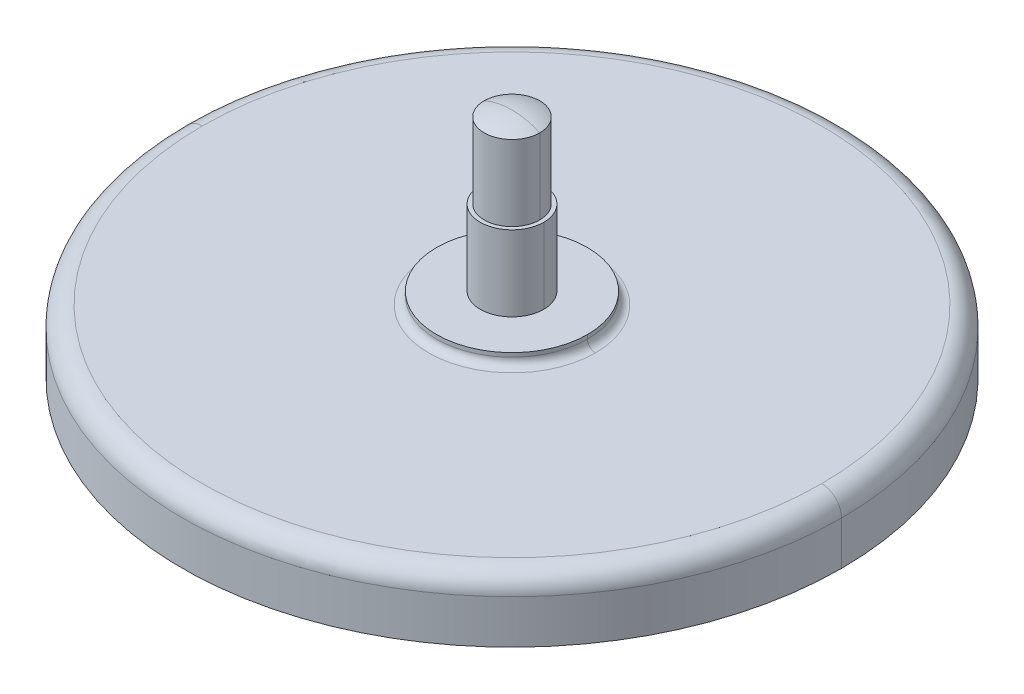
ISO-10303-21;
HEADER;
FILE_DESCRIPTION(('STEP AP214'),'2;1');
FILE_NAME('part.step','',(''),(''),'','','');
FILE_SCHEMA(('AUTOMOTIVE_DESIGN { 1 0 10303 214 1 1 1 1 }'));
ENDSEC;
DATA;
#1=APPLICATION_CONTEXT('core data for automotive mechanical design processes');
#2=APPLICATION_PROTOCOL_DEFINITION('international standard','automotive_design',2000,#1);
#3=PRODUCT_CONTEXT('',#1,'mechanical');
#4=PRODUCT('Part','Part','',(#3));
#5=PRODUCT_RELATED_PRODUCT_CATEGORY('part','',(#4));
#6=PRODUCT_DEFINITION_FORMATION('','',#4);
#7=PRODUCT_DEFINITION_CONTEXT('part definition',#1,'design');
#8=PRODUCT_DEFINITION('design','',#6,#7);
#9=PRODUCT_DEFINITION_SHAPE('','',#8);
#10=(LENGTH_UNIT() NAMED_UNIT(*) SI_UNIT(.MILLI.,.METRE.));
#11=(NAMED_UNIT(*) PLANE_ANGLE_UNIT() SI_UNIT($,.RADIAN.));
#12=(NAMED_UNIT(*) SI_UNIT($,.STERADIAN.) SOLID_ANGLE_UNIT());
#13=UNCERTAINTY_MEASURE_WITH_UNIT(LENGTH_MEASURE(1.E-05),#10,'distance_accuracy_value','');
#14=(GEOMETRIC_REPRESENTATION_CONTEXT(3) GLOBAL_UNCERTAINTY_ASSIGNED_CONTEXT((#13)) GLOBAL_UNIT_ASSIGNED_CONTEXT((#10,
#11,#12)) REPRESENTATION_CONTEXT('',''));
#15=CARTESIAN_POINT('',(0.,0.,0.));
#16=DIRECTION('',(0.,0.,1.));
#17=DIRECTION('',(1.,0.,0.));
#18=AXIS2_PLACEMENT_3D('',#15,#16,#17);
#19=CARTESIAN_POINT('',(1.90385901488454E-12,-544.949342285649,-3.71230823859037E-13));
#20=DIRECTION('',(0.,-1.,0.));
#21=DIRECTION('',(1.,0.,0.));
#22=AXIS2_PLACEMENT_3D('',#19,#20,#21);
#23=CYLINDRICAL_SURFACE('',#22,73.);
#24=DIRECTION('',(0.,-1.,0.));
#25=VECTOR('',#24,1.);
#26=CARTESIAN_POINT('',(-72.9999999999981,-544.94934228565,-2.52878423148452E-13));
#27=LINE('',#26,#25);
#28=CARTESIAN_POINT('',(-73.,0.999999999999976,1.18352400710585E-13));
#29=VERTEX_POINT('',#28);
#30=CARTESIAN_POINT('',(-73.,0.,0.));
#31=VERTEX_POINT('',#30);
#32=EDGE_CURVE('E169',#29,#31,#27,.T.);
#33=ORIENTED_EDGE('',*,*,#32,.F.);
#34=CARTESIAN_POINT('',(0.,1.00000000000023,0.));
#35=DIRECTION('',(0.,-1.,0.));
#36=DIRECTION('',(1.,0.,0.));
#37=AXIS2_PLACEMENT_3D('',#34,#35,#36);
#38=CIRCLE('',#37,73.);
#39=CARTESIAN_POINT('',(73.,1.00000000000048,-1.09412479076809E-13));
#40=VERTEX_POINT('',#39);
#41=EDGE_CURVE('E11',#40,#29,#38,.T.);
#42=ORIENTED_EDGE('',*,*,#41,.F.);
#43=DIRECTION('',(0.,-1.,0.));
#44=VECTOR('',#43,1.);
#45=CARTESIAN_POINT('',(73.0000000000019,-544.949342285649,-4.80643302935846E-13));
#46=LINE('',#45,#44);
#47=CARTESIAN_POINT('',(73.,4.75061106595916E-13,-1.09412479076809E-13));
#48=VERTEX_POINT('',#47);
#49=EDGE_CURVE('E178',#40,#48,#46,.T.);
#50=ORIENTED_EDGE('',*,*,#49,.T.);
#51=CARTESIAN_POINT('',(0.,2.22044604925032E-13,0.));
#52=DIRECTION('',(0.,-1.,0.));
#53=DIRECTION('',(1.,0.,0.));
#54=AXIS2_PLACEMENT_3D('',#51,#52,#53);
#55=CIRCLE('',#54,73.);
#56=EDGE_CURVE('E170',#48,#31,#55,.T.);
#57=ORIENTED_EDGE('',*,*,#56,.T.);
#58=EDGE_LOOP('',(#33,#42,#50,#57));
#59=FACE_BOUND('',#58,.T.);
#60=ADVANCED_FACE('F17',(#59),#23,.F.);
#61=CARTESIAN_POINT('',(0.,1.00000000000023,0.));
#62=DIRECTION('',(0.,-1.,0.));
#63=DIRECTION('',(1.,0.,0.));
#64=AXIS2_PLACEMENT_3D('',#61,#62,#63);
#65=TOROIDAL_SURFACE('',#64,71.,2.);
#66=CARTESIAN_POINT('',(-71.,0.999999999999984,1.15109869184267E-13));
#67=DIRECTION('',(0.,0.,1.));
#68=DIRECTION('',(1.,0.,0.));
#69=AXIS2_PLACEMENT_3D('',#66,#67,#68);
#70=CIRCLE('',#69,2.);
#71=CARTESIAN_POINT('',(-71.,3.,1.17236354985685E-13));
#72=VERTEX_POINT('',#71);
#73=EDGE_CURVE('E151',#72,#29,#70,.T.);
#74=ORIENTED_EDGE('',*,*,#73,.F.);
#75=CARTESIAN_POINT('',(0.,3.00000000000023,0.));
#76=DIRECTION('',(0.,-1.,0.));
#77=DIRECTION('',(1.,0.,0.));
#78=AXIS2_PLACEMENT_3D('',#75,#76,#77);
#79=CIRCLE('',#78,71.);
#80=CARTESIAN_POINT('',(71.,3.00000000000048,-1.06414876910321E-13));
#81=VERTEX_POINT('',#80);
#82=EDGE_CURVE('E20',#81,#72,#79,.T.);
#83=ORIENTED_EDGE('',*,*,#82,.F.);
#84=CARTESIAN_POINT('',(71.,1.00000000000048,-1.06414876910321E-13));
#85=DIRECTION('',(0.,0.,-1.));
#86=DIRECTION('',(-1.,0.,0.));
#87=AXIS2_PLACEMENT_3D('',#84,#85,#86);
#88=CIRCLE('',#87,2.);
#89=EDGE_CURVE('E154',#81,#40,#88,.T.);
#90=ORIENTED_EDGE('',*,*,#89,.T.);
#91=ORIENTED_EDGE('',*,*,#41,.T.);
#92=EDGE_LOOP('',(#74,#83,#90,#91));
#93=FACE_BOUND('',#92,.T.);
#94=ADVANCED_FACE('F150',(#93),#65,.F.);
#95=CARTESIAN_POINT('',(0.,3.00000000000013,0.));
#96=DIRECTION('',(0.,1.,0.));
#97=DIRECTION('',(1.,0.,0.));
#98=AXIS2_PLACEMENT_3D('',#95,#96,#97);
#99=PLANE('',#98);
#100=ORIENTED_EDGE('',*,*,#82,.T.);
#101=CARTESIAN_POINT('',(0.,3.00000000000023,0.));
#102=DIRECTION('',(0.,-1.,0.));
#103=DIRECTION('',(1.,0.,0.));
#104=AXIS2_PLACEMENT_3D('',#101,#102,#103);
#105=CIRCLE('',#104,71.);
#106=EDGE_CURVE('E165',#72,#81,#105,.T.);
#107=ORIENTED_EDGE('',*,*,#106,.T.);
#108=EDGE_LOOP('',(#100,#107));
#109=FACE_BOUND('',#108,.T.);
#110=ADVANCED_FACE('F334',(#109),#99,.F.);
#111=CARTESIAN_POINT('',(0.,41.4166666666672,0.));
#112=DIRECTION('',(0.,0.,1.));
#113=DIRECTION('',(1.,0.,0.));
#114=AXIS2_PLACEMENT_3D('',#111,#112,#113);
#115=SPHERICAL_SURFACE('',#114,17.0833333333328);
#116=CARTESIAN_POINT('',(0.,41.4166666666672,0.));
#117=DIRECTION('',(0.,0.,1.));
#118=DIRECTION('',(1.,0.,0.));
#119=AXIS2_PLACEMENT_3D('',#116,#117,#118);
#120=CIRCLE('',#119,17.0833333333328);
#121=CARTESIAN_POINT('',(0.,58.5,0.));
#122=VERTEX_POINT('',#121);
#123=CARTESIAN_POINT('',(-6.9999999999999,57.,0.));
#124=VERTEX_POINT('',#123);
#125=EDGE_CURVE('E218',#122,#124,#120,.T.);
#126=ORIENTED_EDGE('',*,*,#125,.F.);
#127=CARTESIAN_POINT('',(0.,41.4166666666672,0.));
#128=DIRECTION('',(0.,0.,-1.));
#129=DIRECTION('',(-1.,0.,0.));
#130=AXIS2_PLACEMENT_3D('',#127,#128,#129);
#131=CIRCLE('',#130,17.0833333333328);
#132=CARTESIAN_POINT('',(6.9999999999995,57.,0.));
#133=VERTEX_POINT('',#132);
#134=EDGE_CURVE('E214',#122,#133,#131,.T.);
#135=ORIENTED_EDGE('',*,*,#134,.T.);
#136=CARTESIAN_POINT('',(-1.98625837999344E-13,57.,0.));
#137=DIRECTION('',(0.,-1.,0.));
#138=DIRECTION('',(1.,0.,0.));
#139=AXIS2_PLACEMENT_3D('',#136,#137,#138);
#140=CIRCLE('',#139,6.9999999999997);
#141=EDGE_CURVE('E279',#124,#133,#140,.T.);
#142=ORIENTED_EDGE('',*,*,#141,.F.);
#143=EDGE_LOOP('',(#126,#135,#142));
#144=FACE_BOUND('',#143,.T.);
#145=ADVANCED_FACE('F332',(#144),#115,.T.);
#146=CARTESIAN_POINT('',(1.90385901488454E-12,-544.949342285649,-3.71230823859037E-13));
#147=DIRECTION('',(0.,-1.,0.));
#148=DIRECTION('',(1.,0.,0.));
#149=AXIS2_PLACEMENT_3D('',#146,#147,#148);
#150=CYLINDRICAL_SURFACE('',#149,6.99999999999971);
#151=DIRECTION('',(0.,-1.,0.));
#152=VECTOR('',#151,1.);
#153=CARTESIAN_POINT('',(-6.99999999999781,-544.949342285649,-3.59881963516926E-13));
#154=LINE('',#153,#152);
#155=CARTESIAN_POINT('',(-6.99999999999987,38.,0.));
#156=VERTEX_POINT('',#155);
#157=EDGE_CURVE('E206',#124,#156,#154,.T.);
#158=ORIENTED_EDGE('',*,*,#157,.F.);
#159=ORIENTED_EDGE('',*,*,#141,.T.);
#160=DIRECTION('',(0.,-1.,0.));
#161=VECTOR('',#160,1.);
#162=CARTESIAN_POINT('',(7.00000000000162,-544.949342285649,-3.81722431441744E-13));
#163=LINE('',#162,#161);
#164=CARTESIAN_POINT('',(6.9999999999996,38.,0.));
#165=VERTEX_POINT('',#164);
#166=EDGE_CURVE('E205',#133,#165,#163,.T.);
#167=ORIENTED_EDGE('',*,*,#166,.T.);
#168=CARTESIAN_POINT('',(-1.31838984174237E-13,38.,0.));
#169=DIRECTION('',(0.,-1.,0.));
#170=DIRECTION('',(1.,0.,0.));
#171=AXIS2_PLACEMENT_3D('',#168,#169,#170);
#172=CIRCLE('',#171,6.99999999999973);
#173=EDGE_CURVE('E282',#156,#165,#172,.T.);
#174=ORIENTED_EDGE('',*,*,#173,.F.);
#175=EDGE_LOOP('',(#158,#159,#167,#174));
#176=FACE_BOUND('',#175,.T.);
#177=ADVANCED_FACE('F323',(#176),#150,.T.);
#178=CARTESIAN_POINT('',(-8.,38.,0.));
#179=DIRECTION('',(0.,-1.,0.));
#180=DIRECTION('',(0.,0.,-1.));
#181=AXIS2_PLACEMENT_3D('',#178,#179,#180);
#182=PLANE('',#181);
#183=CARTESIAN_POINT('',(-1.31838984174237E-13,38.,0.));
#184=DIRECTION('',(0.,-1.,0.));
#185=DIRECTION('',(1.,0.,0.));
#186=AXIS2_PLACEMENT_3D('',#183,#184,#185);
#187=CIRCLE('',#186,6.99999999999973);
#188=EDGE_CURVE('E210',#165,#156,#187,.T.);
#189=ORIENTED_EDGE('',*,*,#188,.T.);
#190=ORIENTED_EDGE('',*,*,#173,.T.);
#191=EDGE_LOOP('',(#189,#190));
#192=FACE_BOUND('',#191,.T.);
#193=CARTESIAN_POINT('',(-1.31838984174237E-13,38.,0.));
#194=DIRECTION('',(0.,-1.,0.));
#195=DIRECTION('',(1.,0.,0.));
#196=AXIS2_PLACEMENT_3D('',#193,#194,#195);
#197=CIRCLE('',#196,7.9999999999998);
#198=CARTESIAN_POINT('',(7.99999999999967,38.,0.));
#199=VERTEX_POINT('',#198);
#200=CARTESIAN_POINT('',(-8.,38.,0.));
#201=VERTEX_POINT('',#200);
#202=EDGE_CURVE('E200',#199,#201,#197,.T.);
#203=ORIENTED_EDGE('',*,*,#202,.F.);
#204=CARTESIAN_POINT('',(-1.31838984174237E-13,38.,0.));
#205=DIRECTION('',(0.,-1.,0.));
#206=DIRECTION('',(1.,0.,0.));
#207=AXIS2_PLACEMENT_3D('',#204,#205,#206);
#208=CIRCLE('',#207,7.9999999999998);
#209=EDGE_CURVE('E310',#201,#199,#208,.T.);
#210=ORIENTED_EDGE('',*,*,#209,.F.);
#211=EDGE_LOOP('',(#203,#210));
#212=FACE_BOUND('',#211,.T.);
#213=ADVANCED_FACE('F317',(#192,#212),#182,.F.);
#214=CARTESIAN_POINT('',(1.90385901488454E-12,-544.949342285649,-3.71230823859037E-13));
#215=DIRECTION('',(0.,-1.,0.));
#216=DIRECTION('',(1.,0.,0.));
#217=AXIS2_PLACEMENT_3D('',#214,#215,#216);
#218=CYLINDRICAL_SURFACE('',#217,7.99999999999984);
#219=DIRECTION('',(0.,-1.,0.));
#220=VECTOR('',#219,1.);
#221=CARTESIAN_POINT('',(-7.99999999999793,-544.949342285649,-3.58260697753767E-13));
#222=LINE('',#221,#220);
#223=CARTESIAN_POINT('',(-8.,19.,0.));
#224=VERTEX_POINT('',#223);
#225=EDGE_CURVE('E204',#201,#224,#222,.T.);
#226=ORIENTED_EDGE('',*,*,#225,.F.);
#227=ORIENTED_EDGE('',*,*,#209,.T.);
#228=DIRECTION('',(0.,-1.,0.));
#229=VECTOR('',#228,1.);
#230=CARTESIAN_POINT('',(8.00000000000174,-544.949342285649,-3.83221232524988E-13));
#231=LINE('',#230,#229);
#232=CARTESIAN_POINT('',(7.9999999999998,19.,0.));
#233=VERTEX_POINT('',#232);
#234=EDGE_CURVE('E235',#199,#233,#231,.T.);
#235=ORIENTED_EDGE('',*,*,#234,.T.);
#236=CARTESIAN_POINT('',(0.,19.,0.));
#237=DIRECTION('',(0.,-1.,0.));
#238=DIRECTION('',(1.,0.,0.));
#239=AXIS2_PLACEMENT_3D('',#236,#237,#238);
#240=CIRCLE('',#239,7.99999999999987);
#241=EDGE_CURVE('E307',#224,#233,#240,.T.);
#242=ORIENTED_EDGE('',*,*,#241,.F.);
#243=EDGE_LOOP('',(#226,#227,#235,#242));
#244=FACE_BOUND('',#243,.T.);
#245=ADVANCED_FACE('F384',(#244),#218,.T.);
#246=CARTESIAN_POINT('',(-19.,19.,0.));
#247=DIRECTION('',(0.,-1.,0.));
#248=DIRECTION('',(0.,0.,-1.));
#249=AXIS2_PLACEMENT_3D('',#246,#247,#248);
#250=PLANE('',#249);
#251=CARTESIAN_POINT('',(0.,19.,0.));
#252=DIRECTION('',(0.,-1.,0.));
#253=DIRECTION('',(1.,0.,0.));
#254=AXIS2_PLACEMENT_3D('',#251,#252,#253);
#255=CIRCLE('',#254,7.99999999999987);
#256=EDGE_CURVE('E231',#233,#224,#255,.T.);
#257=ORIENTED_EDGE('',*,*,#256,.T.);
#258=ORIENTED_EDGE('',*,*,#241,.T.);
#259=EDGE_LOOP('',(#257,#258));
#260=FACE_BOUND('',#259,.T.);
#261=CARTESIAN_POINT('',(0.,19.,0.));
#262=DIRECTION('',(0.,-1.,0.));
#263=DIRECTION('',(1.,0.,0.));
#264=AXIS2_PLACEMENT_3D('',#261,#262,#263);
#265=CIRCLE('',#264,19.);
#266=CARTESIAN_POINT('',(19.,19.0000000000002,0.));
#267=VERTEX_POINT('',#266);
#268=CARTESIAN_POINT('',(-19.,19.,0.));
#269=VERTEX_POINT('',#268);
#270=EDGE_CURVE('E239',#267,#269,#265,.T.);
#271=ORIENTED_EDGE('',*,*,#270,.F.);
#272=CARTESIAN_POINT('',(0.,19.,0.));
#273=DIRECTION('',(0.,-1.,0.));
#274=DIRECTION('',(1.,0.,0.));
#275=AXIS2_PLACEMENT_3D('',#272,#273,#274);
#276=CIRCLE('',#275,19.);
#277=EDGE_CURVE('E304',#269,#267,#276,.T.);
#278=ORIENTED_EDGE('',*,*,#277,.F.);
#279=EDGE_LOOP('',(#271,#278));
#280=FACE_BOUND('',#279,.T.);
#281=ADVANCED_FACE('F394',(#260,#280),#250,.F.);
#282=CARTESIAN_POINT('',(1.90385901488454E-12,-544.949342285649,-3.71230823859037E-13));
#283=DIRECTION('',(0.,-1.,0.));
#284=DIRECTION('',(1.,0.,0.));
#285=AXIS2_PLACEMENT_3D('',#282,#283,#284);
#286=CYLINDRICAL_SURFACE('',#285,19.);
#287=DIRECTION('',(0.,-1.,0.));
#288=VECTOR('',#287,1.);
#289=CARTESIAN_POINT('',(-18.999999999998,-544.949342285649,-3.40426774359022E-13));
#290=LINE('',#289,#288);
#291=CARTESIAN_POINT('',(-19.,18.,0.));
#292=VERTEX_POINT('',#291);
#293=EDGE_CURVE('E243',#269,#292,#290,.T.);
#294=ORIENTED_EDGE('',*,*,#293,.F.);
#295=ORIENTED_EDGE('',*,*,#277,.T.);
#296=DIRECTION('',(0.,-1.,0.));
#297=VECTOR('',#296,1.);
#298=CARTESIAN_POINT('',(19.0000000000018,-544.949342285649,-3.99708044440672E-13));
#299=LINE('',#298,#297);
#300=CARTESIAN_POINT('',(19.,18.0000000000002,0.));
#301=VERTEX_POINT('',#300);
#302=EDGE_CURVE('E251',#267,#301,#299,.T.);
#303=ORIENTED_EDGE('',*,*,#302,.T.);
#304=CARTESIAN_POINT('',(0.,18.,0.));
#305=DIRECTION('',(0.,-1.,0.));
#306=DIRECTION('',(1.,0.,0.));
#307=AXIS2_PLACEMENT_3D('',#304,#305,#306);
#308=CIRCLE('',#307,19.);
#309=EDGE_CURVE('E263',#292,#301,#308,.T.);
#310=ORIENTED_EDGE('',*,*,#309,.F.);
#311=EDGE_LOOP('',(#294,#295,#303,#310));
#312=FACE_BOUND('',#311,.T.);
#313=ADVANCED_FACE('F405',(#312),#286,.T.);
#314=CARTESIAN_POINT('',(0.,18.,0.));
#315=DIRECTION('',(0.,-1.,0.));
#316=DIRECTION('',(1.,0.,0.));
#317=AXIS2_PLACEMENT_3D('',#314,#315,#316);
#318=TOROIDAL_SURFACE('',#317,21.,2.);
#319=CARTESIAN_POINT('',(-21.,18.,0.));
#320=DIRECTION('',(0.,0.,1.));
#321=DIRECTION('',(1.,0.,0.));
#322=AXIS2_PLACEMENT_3D('',#319,#320,#321);
#323=CIRCLE('',#322,2.);
#324=CARTESIAN_POINT('',(-21.,16.,0.));
#325=VERTEX_POINT('',#324);
#326=EDGE_CURVE('E259',#325,#292,#323,.T.);
#327=ORIENTED_EDGE('',*,*,#326,.F.);
#328=CARTESIAN_POINT('',(0.,16.,0.));
#329=DIRECTION('',(0.,-1.,0.));
#330=DIRECTION('',(1.,0.,0.));
#331=AXIS2_PLACEMENT_3D('',#328,#329,#330);
#332=CIRCLE('',#331,21.);
#333=CARTESIAN_POINT('',(21.,16.0000000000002,0.));
#334=VERTEX_POINT('',#333);
#335=EDGE_CURVE('E301',#334,#325,#332,.T.);
#336=ORIENTED_EDGE('',*,*,#335,.F.);
#337=CARTESIAN_POINT('',(21.,18.,0.));
#338=DIRECTION('',(0.,0.,-1.));
#339=DIRECTION('',(-1.,0.,0.));
#340=AXIS2_PLACEMENT_3D('',#337,#338,#339);
#341=CIRCLE('',#340,2.);
#342=EDGE_CURVE('E267',#334,#301,#341,.T.);
#343=ORIENTED_EDGE('',*,*,#342,.T.);
#344=CARTESIAN_POINT('',(0.,18.,0.));
#345=DIRECTION('',(0.,-1.,0.));
#346=DIRECTION('',(1.,0.,0.));
#347=AXIS2_PLACEMENT_3D('',#344,#345,#346);
#348=CIRCLE('',#347,19.);
#349=EDGE_CURVE('E247',#301,#292,#348,.T.);
#350=ORIENTED_EDGE('',*,*,#349,.T.);
#351=EDGE_LOOP('',(#327,#336,#343,#350));
#352=FACE_BOUND('',#351,.T.);
#353=ADVANCED_FACE('F416',(#352),#318,.F.);
#354=CARTESIAN_POINT('',(-78.,15.9999999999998,1.14491749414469E-13));
#355=DIRECTION('',(0.,-1.,0.));
#356=DIRECTION('',(0.,0.,-1.));
#357=AXIS2_PLACEMENT_3D('',#354,#355,#356);
#358=PLANE('',#357);
#359=ORIENTED_EDGE('',*,*,#335,.T.);
#360=CARTESIAN_POINT('',(0.,16.,0.));
#361=DIRECTION('',(0.,-1.,0.));
#362=DIRECTION('',(1.,0.,0.));
#363=AXIS2_PLACEMENT_3D('',#360,#361,#362);
#364=CIRCLE('',#363,21.);
#365=EDGE_CURVE('E255',#325,#334,#364,.T.);
#366=ORIENTED_EDGE('',*,*,#365,.T.);
#367=EDGE_LOOP('',(#359,#366));
#368=FACE_BOUND('',#367,.T.);
#369=CARTESIAN_POINT('',(0.,16.0000000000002,0.));
#370=DIRECTION('',(0.,-1.,0.));
#371=DIRECTION('',(1.,0.,0.));
#372=AXIS2_PLACEMENT_3D('',#369,#370,#371);
#373=CIRCLE('',#372,78.);
#374=CARTESIAN_POINT('',(78.,16.0000000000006,-1.16906484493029E-13));
#375=VERTEX_POINT('',#374);
#376=CARTESIAN_POINT('',(-78.,16.,1.31774944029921E-13));
#377=VERTEX_POINT('',#376);
#378=EDGE_CURVE('E270',#375,#377,#373,.T.);
#379=ORIENTED_EDGE('',*,*,#378,.F.);
#380=CARTESIAN_POINT('',(0.,16.0000000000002,0.));
#381=DIRECTION('',(0.,-1.,0.));
#382=DIRECTION('',(1.,0.,0.));
#383=AXIS2_PLACEMENT_3D('',#380,#381,#382);
#384=CIRCLE('',#383,78.);
#385=EDGE_CURVE('E298',#377,#375,#384,.T.);
#386=ORIENTED_EDGE('',*,*,#385,.F.);
#387=EDGE_LOOP('',(#379,#386));
#388=FACE_BOUND('',#387,.T.);
#389=ADVANCED_FACE('F427',(#368,#388),#358,.F.);
#390=CARTESIAN_POINT('',(0.,11.0000000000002,0.));
#391=DIRECTION('',(0.,-1.,0.));
#392=DIRECTION('',(1.,0.,0.));
#393=AXIS2_PLACEMENT_3D('',#390,#391,#392);
#394=TOROIDAL_SURFACE('',#393,78.,5.);
#395=CARTESIAN_POINT('',(-78.,11.,1.26458729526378E-13));
#396=DIRECTION('',(0.,0.,1.));
#397=DIRECTION('',(1.,0.,0.));
#398=AXIS2_PLACEMENT_3D('',#395,#396,#397);
#399=CIRCLE('',#398,5.);
#400=CARTESIAN_POINT('',(-83.,11.,0.));
#401=VERTEX_POINT('',#400);
#402=EDGE_CURVE('E274',#377,#401,#399,.T.);
#403=ORIENTED_EDGE('',*,*,#402,.F.);
#404=ORIENTED_EDGE('',*,*,#385,.T.);
#405=CARTESIAN_POINT('',(78.,11.0000000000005,-1.16906484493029E-13));
#406=DIRECTION('',(0.,0.,-1.));
#407=DIRECTION('',(-1.,0.,0.));
#408=AXIS2_PLACEMENT_3D('',#405,#406,#407);
#409=CIRCLE('',#408,5.);
#410=CARTESIAN_POINT('',(83.,11.0000000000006,-1.24400489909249E-13));
#411=VERTEX_POINT('',#410);
#412=EDGE_CURVE('E192',#375,#411,#409,.T.);
#413=ORIENTED_EDGE('',*,*,#412,.T.);
#414=CARTESIAN_POINT('',(0.,11.0000000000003,0.));
#415=DIRECTION('',(0.,-1.,0.));
#416=DIRECTION('',(1.,0.,0.));
#417=AXIS2_PLACEMENT_3D('',#414,#415,#416);
#418=CIRCLE('',#417,83.);
#419=EDGE_CURVE('E186',#401,#411,#418,.T.);
#420=ORIENTED_EDGE('',*,*,#419,.F.);
#421=EDGE_LOOP('',(#403,#404,#413,#420));
#422=FACE_BOUND('',#421,.T.);
#423=ADVANCED_FACE('F438',(#422),#394,.T.);
#424=CARTESIAN_POINT('',(1.90385901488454E-12,-544.949342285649,-3.71230823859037E-13));
#425=DIRECTION('',(0.,-1.,0.));
#426=DIRECTION('',(1.,0.,0.));
#427=AXIS2_PLACEMENT_3D('',#424,#425,#426);
#428=CYLINDRICAL_SURFACE('',#427,83.);
#429=DIRECTION('',(0.,-1.,0.));
#430=VECTOR('',#429,1.);
#431=CARTESIAN_POINT('',(-82.9999999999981,-544.94934228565,-2.36665765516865E-13));
#432=LINE('',#431,#430);
#433=CARTESIAN_POINT('',(-83.,0.,0.));
#434=VERTEX_POINT('',#433);
#435=EDGE_CURVE('E188',#401,#434,#432,.T.);
#436=ORIENTED_EDGE('',*,*,#435,.F.);
#437=ORIENTED_EDGE('',*,*,#419,.T.);
#438=DIRECTION('',(0.,-1.,0.));
#439=VECTOR('',#438,1.);
#440=CARTESIAN_POINT('',(83.0000000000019,-544.949342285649,-4.95631313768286E-13));
#441=LINE('',#440,#439);
#442=CARTESIAN_POINT('',(83.,6.27682097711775E-13,-1.24400489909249E-13));
#443=VERTEX_POINT('',#442);
#444=EDGE_CURVE('E291',#411,#443,#441,.T.);
#445=ORIENTED_EDGE('',*,*,#444,.T.);
#446=CARTESIAN_POINT('',(0.,3.40005801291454E-13,0.));
#447=DIRECTION('',(0.,-1.,0.));
#448=DIRECTION('',(1.,0.,0.));
#449=AXIS2_PLACEMENT_3D('',#446,#447,#448);
#450=CIRCLE('',#449,83.);
#451=EDGE_CURVE('E38',#434,#443,#450,.T.);
#452=ORIENTED_EDGE('',*,*,#451,.F.);
#453=EDGE_LOOP('',(#436,#437,#445,#452));
#454=FACE_BOUND('',#453,.T.);
#455=ADVANCED_FACE('F449',(#454),#428,.T.);
#456=CARTESIAN_POINT('',(-73.,0.,1.14491749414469E-13));
#457=DIRECTION('',(0.,1.,0.));
#458=DIRECTION('',(1.,0.,0.));
#459=AXIS2_PLACEMENT_3D('',#456,#457,#458);
#460=PLANE('',#459);
#461=ORIENTED_EDGE('',*,*,#56,.F.);
#462=CARTESIAN_POINT('',(0.,2.22044604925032E-13,0.));
#463=DIRECTION('',(0.,-1.,0.));
#464=DIRECTION('',(1.,0.,0.));
#465=AXIS2_PLACEMENT_3D('',#462,#463,#464);
#466=CIRCLE('',#465,73.);
#467=EDGE_CURVE('E175',#31,#48,#466,.T.);
#468=ORIENTED_EDGE('',*,*,#467,.F.);
#469=EDGE_LOOP('',(#461,#468));
#470=FACE_BOUND('',#469,.T.);
#471=CARTESIAN_POINT('',(0.,3.40005801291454E-13,0.));
#472=DIRECTION('',(0.,-1.,0.));
#473=DIRECTION('',(1.,0.,0.));
#474=AXIS2_PLACEMENT_3D('',#471,#472,#473);
#475=CIRCLE('',#474,83.);
#476=EDGE_CURVE('E191',#443,#434,#475,.T.);
#477=ORIENTED_EDGE('',*,*,#476,.T.);
#478=ORIENTED_EDGE('',*,*,#451,.T.);
#479=EDGE_LOOP('',(#477,#478));
#480=FACE_BOUND('',#479,.T.);
#481=ADVANCED_FACE('F460',(#470,#480),#460,.F.);
#482=CARTESIAN_POINT('',(1.90385901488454E-12,-544.949342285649,-3.71230823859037E-13));
#483=DIRECTION('',(0.,-1.,0.));
#484=DIRECTION('',(1.,0.,0.));
#485=AXIS2_PLACEMENT_3D('',#482,#483,#484);
#486=CYLINDRICAL_SURFACE('',#485,83.);
#487=CARTESIAN_POINT('',(0.,11.0000000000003,0.));
#488=DIRECTION('',(0.,-1.,0.));
#489=DIRECTION('',(1.,0.,0.));
#490=AXIS2_PLACEMENT_3D('',#487,#488,#489);
#491=CIRCLE('',#490,83.);
#492=EDGE_CURVE('E278',#411,#401,#491,.T.);
#493=ORIENTED_EDGE('',*,*,#492,.T.);
#494=ORIENTED_EDGE('',*,*,#435,.T.);
#495=ORIENTED_EDGE('',*,*,#476,.F.);
#496=ORIENTED_EDGE('',*,*,#444,.F.);
#497=EDGE_LOOP('',(#493,#494,#495,#496));
#498=FACE_BOUND('',#497,.T.);
#499=ADVANCED_FACE('F470',(#498),#486,.T.);
#500=CARTESIAN_POINT('',(0.,11.0000000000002,0.));
#501=DIRECTION('',(0.,-1.,0.));
#502=DIRECTION('',(1.,0.,0.));
#503=AXIS2_PLACEMENT_3D('',#500,#501,#502);
#504=TOROIDAL_SURFACE('',#503,78.,5.);
#505=ORIENTED_EDGE('',*,*,#378,.T.);
#506=ORIENTED_EDGE('',*,*,#402,.T.);
#507=ORIENTED_EDGE('',*,*,#492,.F.);
#508=ORIENTED_EDGE('',*,*,#412,.F.);
#509=EDGE_LOOP('',(#505,#506,#507,#508));
#510=FACE_BOUND('',#509,.T.);
#511=ADVANCED_FACE('F481',(#510),#504,.T.);
#512=CARTESIAN_POINT('',(0.,18.,0.));
#513=DIRECTION('',(0.,-1.,0.));
#514=DIRECTION('',(1.,0.,0.));
#515=AXIS2_PLACEMENT_3D('',#512,#513,#514);
#516=TOROIDAL_SURFACE('',#515,21.,2.);
#517=ORIENTED_EDGE('',*,*,#365,.F.);
#518=ORIENTED_EDGE('',*,*,#326,.T.);
#519=ORIENTED_EDGE('',*,*,#309,.T.);
#520=ORIENTED_EDGE('',*,*,#342,.F.);
#521=EDGE_LOOP('',(#517,#518,#519,#520));
#522=FACE_BOUND('',#521,.T.);
#523=ADVANCED_FACE('F492',(#522),#516,.F.);
#524=CARTESIAN_POINT('',(1.90385901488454E-12,-544.949342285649,-3.71230823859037E-13));
#525=DIRECTION('',(0.,-1.,0.));
#526=DIRECTION('',(1.,0.,0.));
#527=AXIS2_PLACEMENT_3D('',#524,#525,#526);
#528=CYLINDRICAL_SURFACE('',#527,19.);
#529=ORIENTED_EDGE('',*,*,#270,.T.);
#530=ORIENTED_EDGE('',*,*,#293,.T.);
#531=ORIENTED_EDGE('',*,*,#349,.F.);
#532=ORIENTED_EDGE('',*,*,#302,.F.);
#533=EDGE_LOOP('',(#529,#530,#531,#532));
#534=FACE_BOUND('',#533,.T.);
#535=ADVANCED_FACE('F503',(#534),#528,.T.);
#536=CARTESIAN_POINT('',(1.90385901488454E-12,-544.949342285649,-3.71230823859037E-13));
#537=DIRECTION('',(0.,-1.,0.));
#538=DIRECTION('',(1.,0.,0.));
#539=AXIS2_PLACEMENT_3D('',#536,#537,#538);
#540=CYLINDRICAL_SURFACE('',#539,7.99999999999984);
#541=ORIENTED_EDGE('',*,*,#202,.T.);
#542=ORIENTED_EDGE('',*,*,#225,.T.);
#543=ORIENTED_EDGE('',*,*,#256,.F.);
#544=ORIENTED_EDGE('',*,*,#234,.F.);
#545=EDGE_LOOP('',(#541,#542,#543,#544));
#546=FACE_BOUND('',#545,.T.);
#547=ADVANCED_FACE('F514',(#546),#540,.T.);
#548=CARTESIAN_POINT('',(1.90385901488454E-12,-544.949342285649,-3.71230823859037E-13));
#549=DIRECTION('',(0.,-1.,0.));
#550=DIRECTION('',(1.,0.,0.));
#551=AXIS2_PLACEMENT_3D('',#548,#549,#550);
#552=CYLINDRICAL_SURFACE('',#551,6.99999999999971);
#553=CARTESIAN_POINT('',(-1.98625837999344E-13,57.,0.));
#554=DIRECTION('',(0.,-1.,0.));
#555=DIRECTION('',(1.,0.,0.));
#556=AXIS2_PLACEMENT_3D('',#553,#554,#555);
#557=CIRCLE('',#556,6.9999999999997);
#558=EDGE_CURVE('E211',#133,#124,#557,.T.);
#559=ORIENTED_EDGE('',*,*,#558,.T.);
#560=ORIENTED_EDGE('',*,*,#157,.T.);
#561=ORIENTED_EDGE('',*,*,#188,.F.);
#562=ORIENTED_EDGE('',*,*,#166,.F.);
#563=EDGE_LOOP('',(#559,#560,#561,#562));
#564=FACE_BOUND('',#563,.T.);
#565=ADVANCED_FACE('F327',(#564),#552,.T.);
#566=CARTESIAN_POINT('',(0.,41.4166666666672,0.));
#567=DIRECTION('',(0.,0.,1.));
#568=DIRECTION('',(1.,0.,0.));
#569=AXIS2_PLACEMENT_3D('',#566,#567,#568);
#570=SPHERICAL_SURFACE('',#569,17.0833333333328);
#571=ORIENTED_EDGE('',*,*,#134,.F.);
#572=ORIENTED_EDGE('',*,*,#125,.T.);
#573=ORIENTED_EDGE('',*,*,#558,.F.);
#574=EDGE_LOOP('',(#571,#572,#573));
#575=FACE_BOUND('',#574,.T.);
#576=ADVANCED_FACE('F330',(#575),#570,.T.);
#577=CARTESIAN_POINT('',(0.,1.00000000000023,0.));
#578=DIRECTION('',(0.,-1.,0.));
#579=DIRECTION('',(1.,0.,0.));
#580=AXIS2_PLACEMENT_3D('',#577,#578,#579);
#581=TOROIDAL_SURFACE('',#580,71.,2.);
#582=ORIENTED_EDGE('',*,*,#106,.F.);
#583=ORIENTED_EDGE('',*,*,#73,.T.);
#584=CARTESIAN_POINT('',(0.,1.00000000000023,0.));
#585=DIRECTION('',(0.,-1.,0.));
#586=DIRECTION('',(1.,0.,0.));
#587=AXIS2_PLACEMENT_3D('',#584,#585,#586);
#588=CIRCLE('',#587,73.);
#589=EDGE_CURVE('E163',#29,#40,#588,.T.);
#590=ORIENTED_EDGE('',*,*,#589,.T.);
#591=ORIENTED_EDGE('',*,*,#89,.F.);
#592=EDGE_LOOP('',(#582,#583,#590,#591));
#593=FACE_BOUND('',#592,.T.);
#594=ADVANCED_FACE('F161',(#593),#581,.F.);
#595=CARTESIAN_POINT('',(1.90385901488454E-12,-544.949342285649,-3.71230823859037E-13));
#596=DIRECTION('',(0.,-1.,0.));
#597=DIRECTION('',(1.,0.,0.));
#598=AXIS2_PLACEMENT_3D('',#595,#596,#597);
#599=CYLINDRICAL_SURFACE('',#598,73.);
#600=ORIENTED_EDGE('',*,*,#589,.F.);
#601=ORIENTED_EDGE('',*,*,#32,.T.);
#602=ORIENTED_EDGE('',*,*,#467,.T.);
#603=ORIENTED_EDGE('',*,*,#49,.F.);
#604=EDGE_LOOP('',(#600,#601,#602,#603));
#605=FACE_BOUND('',#604,.T.);
#606=ADVANCED_FACE('F177',(#605),#599,.F.);
#607=CLOSED_SHELL('',(#60,#94,#110,#145,#177,#213,#245,#281,#313,#353,#389,#423,#455,#481,#499,
#511,#523,#535,#547,#565,#576,#594,#606));
#608=MANIFOLD_SOLID_BREP('B1',#607);
#609=ADVANCED_BREP_SHAPE_REPRESENTATION('',(#18,#608),#14);
#610=SHAPE_DEFINITION_REPRESENTATION(#9,#609);
ENDSEC;
END-ISO-10303-21;
